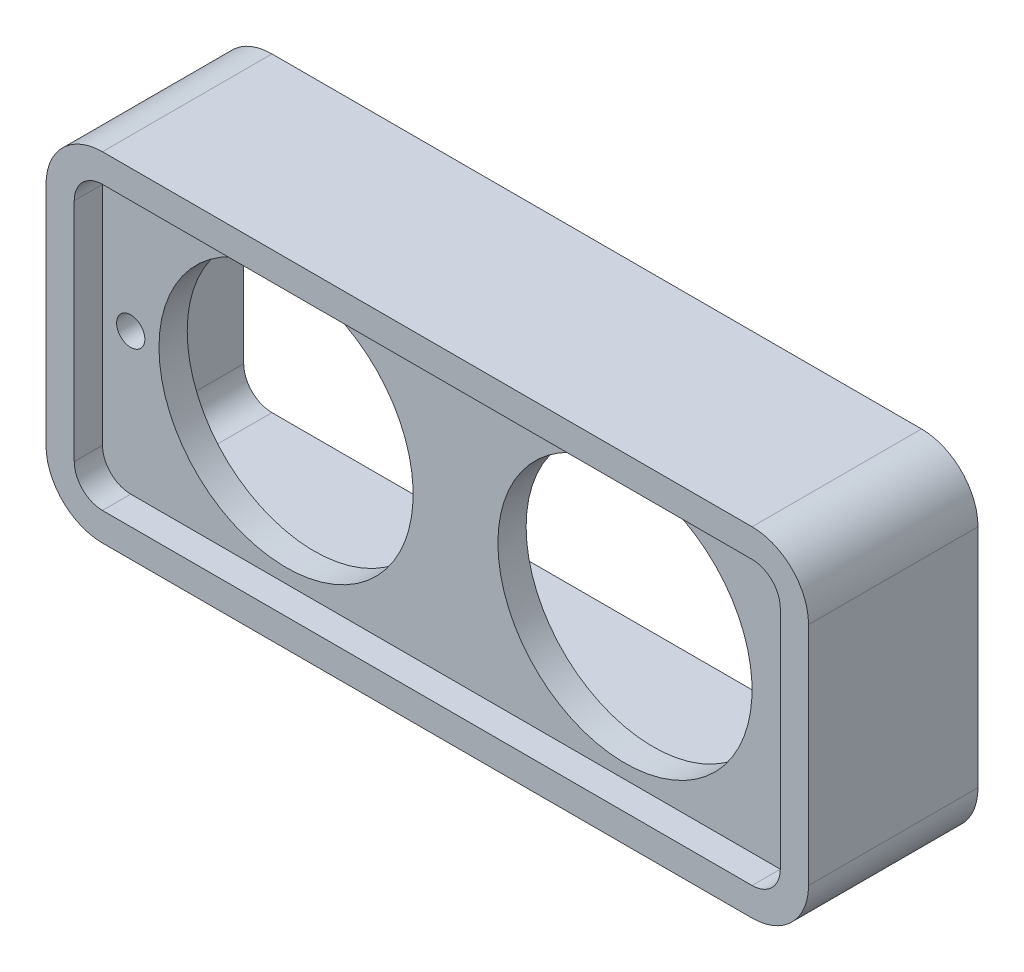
ISO-10303-21;
HEADER;
FILE_DESCRIPTION(('STEP AP214'),'2;1');
FILE_NAME('part.step','',(''),(''),'','','');
FILE_SCHEMA(('AUTOMOTIVE_DESIGN { 1 0 10303 214 1 1 1 1 }'));
ENDSEC;
DATA;
#1=APPLICATION_CONTEXT('core data for automotive mechanical design processes');
#2=APPLICATION_PROTOCOL_DEFINITION('international standard','automotive_design',2000,#1);
#3=PRODUCT_CONTEXT('',#1,'mechanical');
#4=PRODUCT('Part','Part','',(#3));
#5=PRODUCT_RELATED_PRODUCT_CATEGORY('part','',(#4));
#6=PRODUCT_DEFINITION_FORMATION('','',#4);
#7=PRODUCT_DEFINITION_CONTEXT('part definition',#1,'design');
#8=PRODUCT_DEFINITION('design','',#6,#7);
#9=PRODUCT_DEFINITION_SHAPE('','',#8);
#10=(LENGTH_UNIT() NAMED_UNIT(*) SI_UNIT(.MILLI.,.METRE.));
#11=(NAMED_UNIT(*) PLANE_ANGLE_UNIT() SI_UNIT($,.RADIAN.));
#12=(NAMED_UNIT(*) SI_UNIT($,.STERADIAN.) SOLID_ANGLE_UNIT());
#13=UNCERTAINTY_MEASURE_WITH_UNIT(LENGTH_MEASURE(1.E-05),#10,'distance_accuracy_value','');
#14=(GEOMETRIC_REPRESENTATION_CONTEXT(3) GLOBAL_UNCERTAINTY_ASSIGNED_CONTEXT((#13)) GLOBAL_UNIT_ASSIGNED_CONTEXT((#10,
#11,#12)) REPRESENTATION_CONTEXT('',''));
#15=CARTESIAN_POINT('',(0.,0.,0.));
#16=DIRECTION('',(0.,0.,1.));
#17=DIRECTION('',(1.,0.,0.));
#18=AXIS2_PLACEMENT_3D('',#15,#16,#17);
#19=CARTESIAN_POINT('',(-11.5,-4.,-6.));
#20=DIRECTION('',(0.,0.,1.));
#21=DIRECTION('',(1.,0.,0.));
#22=AXIS2_PLACEMENT_3D('',#19,#20,#21);
#23=CYLINDRICAL_SURFACE('',#22,2.);
#24=CARTESIAN_POINT('',(-11.5,-4.,0.));
#25=DIRECTION('',(0.,0.,1.));
#26=DIRECTION('',(-1.,0.,0.));
#27=AXIS2_PLACEMENT_3D('',#24,#25,#26);
#28=CIRCLE('',#27,2.);
#29=CARTESIAN_POINT('',(-13.5,-4.,0.));
#30=VERTEX_POINT('',#29);
#31=CARTESIAN_POINT('',(-11.5,-6.,0.));
#32=VERTEX_POINT('',#31);
#33=EDGE_CURVE('E364',#30,#32,#28,.T.);
#34=ORIENTED_EDGE('',*,*,#33,.F.);
#35=DIRECTION('',(0.,0.,1.));
#36=VECTOR('',#35,1.);
#37=CARTESIAN_POINT('',(-13.5,-4.,-6.));
#38=LINE('',#37,#36);
#39=CARTESIAN_POINT('',(-13.5,-4.,-6.));
#40=VERTEX_POINT('',#39);
#41=EDGE_CURVE('E11',#40,#30,#38,.T.);
#42=ORIENTED_EDGE('',*,*,#41,.F.);
#43=CARTESIAN_POINT('',(-11.5,-4.,-6.));
#44=DIRECTION('',(0.,0.,1.));
#45=DIRECTION('',(-1.,0.,0.));
#46=AXIS2_PLACEMENT_3D('',#43,#44,#45);
#47=CIRCLE('',#46,2.);
#48=CARTESIAN_POINT('',(-11.5,-6.,-6.));
#49=VERTEX_POINT('',#48);
#50=EDGE_CURVE('E338',#40,#49,#47,.T.);
#51=ORIENTED_EDGE('',*,*,#50,.T.);
#52=DIRECTION('',(0.,0.,1.));
#53=VECTOR('',#52,1.);
#54=CARTESIAN_POINT('',(-11.5,-6.,-6.));
#55=LINE('',#54,#53);
#56=EDGE_CURVE('E363',#49,#32,#55,.T.);
#57=ORIENTED_EDGE('',*,*,#56,.T.);
#58=EDGE_LOOP('',(#34,#42,#51,#57));
#59=FACE_BOUND('',#58,.T.);
#60=ADVANCED_FACE('F31',(#59),#23,.T.);
#61=CARTESIAN_POINT('',(-13.5,-4.,-6.));
#62=DIRECTION('',(-1.,0.,0.));
#63=DIRECTION('',(0.,0.,1.));
#64=AXIS2_PLACEMENT_3D('',#61,#62,#63);
#65=PLANE('',#64);
#66=DIRECTION('',(0.,-1.,0.));
#67=VECTOR('',#66,1.);
#68=CARTESIAN_POINT('',(-13.5,-4.,0.));
#69=LINE('',#68,#67);
#70=CARTESIAN_POINT('',(-13.5,4.,0.));
#71=VERTEX_POINT('',#70);
#72=EDGE_CURVE('E342',#71,#30,#69,.T.);
#73=ORIENTED_EDGE('',*,*,#72,.F.);
#74=DIRECTION('',(0.,0.,1.));
#75=VECTOR('',#74,1.);
#76=CARTESIAN_POINT('',(-13.5,4.,-6.));
#77=LINE('',#76,#75);
#78=CARTESIAN_POINT('',(-13.5,4.,-6.));
#79=VERTEX_POINT('',#78);
#80=EDGE_CURVE('E39',#79,#71,#77,.T.);
#81=ORIENTED_EDGE('',*,*,#80,.F.);
#82=DIRECTION('',(0.,-1.,0.));
#83=VECTOR('',#82,1.);
#84=CARTESIAN_POINT('',(-13.5,-4.,-6.));
#85=LINE('',#84,#83);
#86=EDGE_CURVE('E360',#79,#40,#85,.T.);
#87=ORIENTED_EDGE('',*,*,#86,.T.);
#88=ORIENTED_EDGE('',*,*,#41,.T.);
#89=EDGE_LOOP('',(#73,#81,#87,#88));
#90=FACE_BOUND('',#89,.T.);
#91=ADVANCED_FACE('F422',(#90),#65,.T.);
#92=CARTESIAN_POINT('',(-11.5,4.,-6.));
#93=DIRECTION('',(0.,0.,1.));
#94=DIRECTION('',(1.,0.,0.));
#95=AXIS2_PLACEMENT_3D('',#92,#93,#94);
#96=CYLINDRICAL_SURFACE('',#95,2.);
#97=CARTESIAN_POINT('',(-11.5,4.,0.));
#98=DIRECTION('',(0.,0.,1.));
#99=DIRECTION('',(-1.,0.,0.));
#100=AXIS2_PLACEMENT_3D('',#97,#98,#99);
#101=CIRCLE('',#100,2.);
#102=CARTESIAN_POINT('',(-11.5,6.,0.));
#103=VERTEX_POINT('',#102);
#104=EDGE_CURVE('E382',#103,#71,#101,.T.);
#105=ORIENTED_EDGE('',*,*,#104,.F.);
#106=DIRECTION('',(0.,0.,1.));
#107=VECTOR('',#106,1.);
#108=CARTESIAN_POINT('',(-11.5,6.,-6.));
#109=LINE('',#108,#107);
#110=CARTESIAN_POINT('',(-11.5,6.,-6.));
#111=VERTEX_POINT('',#110);
#112=EDGE_CURVE('E388',#111,#103,#109,.T.);
#113=ORIENTED_EDGE('',*,*,#112,.F.);
#114=CARTESIAN_POINT('',(-11.5,4.,-6.));
#115=DIRECTION('',(0.,0.,1.));
#116=DIRECTION('',(-1.,0.,0.));
#117=AXIS2_PLACEMENT_3D('',#114,#115,#116);
#118=CIRCLE('',#117,2.);
#119=EDGE_CURVE('E357',#111,#79,#118,.T.);
#120=ORIENTED_EDGE('',*,*,#119,.T.);
#121=ORIENTED_EDGE('',*,*,#80,.T.);
#122=EDGE_LOOP('',(#105,#113,#120,#121));
#123=FACE_BOUND('',#122,.T.);
#124=ADVANCED_FACE('F427',(#123),#96,.T.);
#125=CARTESIAN_POINT('',(-11.5,6.,-6.));
#126=DIRECTION('',(0.,1.,0.));
#127=DIRECTION('',(-1.,0.,0.));
#128=AXIS2_PLACEMENT_3D('',#125,#126,#127);
#129=PLANE('',#128);
#130=DIRECTION('',(-1.,0.,0.));
#131=VECTOR('',#130,1.);
#132=CARTESIAN_POINT('',(-11.5,6.,0.));
#133=LINE('',#132,#131);
#134=CARTESIAN_POINT('',(11.5,6.,0.));
#135=VERTEX_POINT('',#134);
#136=EDGE_CURVE('E379',#135,#103,#133,.T.);
#137=ORIENTED_EDGE('',*,*,#136,.F.);
#138=DIRECTION('',(0.,0.,1.));
#139=VECTOR('',#138,1.);
#140=CARTESIAN_POINT('',(11.5,6.,-6.));
#141=LINE('',#140,#139);
#142=CARTESIAN_POINT('',(11.5,6.,-6.));
#143=VERTEX_POINT('',#142);
#144=EDGE_CURVE('E390',#143,#135,#141,.T.);
#145=ORIENTED_EDGE('',*,*,#144,.F.);
#146=DIRECTION('',(-1.,0.,0.));
#147=VECTOR('',#146,1.);
#148=CARTESIAN_POINT('',(-11.5,6.,-6.));
#149=LINE('',#148,#147);
#150=EDGE_CURVE('E354',#143,#111,#149,.T.);
#151=ORIENTED_EDGE('',*,*,#150,.T.);
#152=ORIENTED_EDGE('',*,*,#112,.T.);
#153=EDGE_LOOP('',(#137,#145,#151,#152));
#154=FACE_BOUND('',#153,.T.);
#155=ADVANCED_FACE('F458',(#154),#129,.T.);
#156=CARTESIAN_POINT('',(11.5,4.,-6.));
#157=DIRECTION('',(0.,0.,1.));
#158=DIRECTION('',(1.,0.,0.));
#159=AXIS2_PLACEMENT_3D('',#156,#157,#158);
#160=CYLINDRICAL_SURFACE('',#159,2.);
#161=CARTESIAN_POINT('',(11.5,4.,0.));
#162=DIRECTION('',(0.,0.,1.));
#163=DIRECTION('',(-1.,0.,0.));
#164=AXIS2_PLACEMENT_3D('',#161,#162,#163);
#165=CIRCLE('',#164,2.);
#166=CARTESIAN_POINT('',(13.5,4.,0.));
#167=VERTEX_POINT('',#166);
#168=EDGE_CURVE('E376',#167,#135,#165,.T.);
#169=ORIENTED_EDGE('',*,*,#168,.F.);
#170=DIRECTION('',(0.,0.,1.));
#171=VECTOR('',#170,1.);
#172=CARTESIAN_POINT('',(13.5,4.,-6.));
#173=LINE('',#172,#171);
#174=CARTESIAN_POINT('',(13.5,4.,-6.));
#175=VERTEX_POINT('',#174);
#176=EDGE_CURVE('E392',#175,#167,#173,.T.);
#177=ORIENTED_EDGE('',*,*,#176,.F.);
#178=CARTESIAN_POINT('',(11.5,4.,-6.));
#179=DIRECTION('',(0.,0.,1.));
#180=DIRECTION('',(-1.,0.,0.));
#181=AXIS2_PLACEMENT_3D('',#178,#179,#180);
#182=CIRCLE('',#181,2.);
#183=EDGE_CURVE('E351',#175,#143,#182,.T.);
#184=ORIENTED_EDGE('',*,*,#183,.T.);
#185=ORIENTED_EDGE('',*,*,#144,.T.);
#186=EDGE_LOOP('',(#169,#177,#184,#185));
#187=FACE_BOUND('',#186,.T.);
#188=ADVANCED_FACE('F455',(#187),#160,.T.);
#189=CARTESIAN_POINT('',(13.5,-4.,-6.));
#190=DIRECTION('',(1.,0.,0.));
#191=DIRECTION('',(0.,0.,-1.));
#192=AXIS2_PLACEMENT_3D('',#189,#190,#191);
#193=PLANE('',#192);
#194=DIRECTION('',(0.,1.,0.));
#195=VECTOR('',#194,1.);
#196=CARTESIAN_POINT('',(13.5,-4.,0.));
#197=LINE('',#196,#195);
#198=CARTESIAN_POINT('',(13.5,-4.,0.));
#199=VERTEX_POINT('',#198);
#200=EDGE_CURVE('E373',#199,#167,#197,.T.);
#201=ORIENTED_EDGE('',*,*,#200,.F.);
#202=DIRECTION('',(0.,0.,1.));
#203=VECTOR('',#202,1.);
#204=CARTESIAN_POINT('',(13.5,-4.,-6.));
#205=LINE('',#204,#203);
#206=CARTESIAN_POINT('',(13.5,-4.,-6.));
#207=VERTEX_POINT('',#206);
#208=EDGE_CURVE('E394',#207,#199,#205,.T.);
#209=ORIENTED_EDGE('',*,*,#208,.F.);
#210=DIRECTION('',(0.,1.,0.));
#211=VECTOR('',#210,1.);
#212=CARTESIAN_POINT('',(13.5,-4.,-6.));
#213=LINE('',#212,#211);
#214=EDGE_CURVE('E348',#207,#175,#213,.T.);
#215=ORIENTED_EDGE('',*,*,#214,.T.);
#216=ORIENTED_EDGE('',*,*,#176,.T.);
#217=EDGE_LOOP('',(#201,#209,#215,#216));
#218=FACE_BOUND('',#217,.T.);
#219=ADVANCED_FACE('F451',(#218),#193,.T.);
#220=CARTESIAN_POINT('',(11.5,-4.,-6.));
#221=DIRECTION('',(0.,0.,1.));
#222=DIRECTION('',(1.,0.,0.));
#223=AXIS2_PLACEMENT_3D('',#220,#221,#222);
#224=CYLINDRICAL_SURFACE('',#223,2.);
#225=CARTESIAN_POINT('',(11.5,-4.,0.));
#226=DIRECTION('',(0.,0.,1.));
#227=DIRECTION('',(1.,0.,0.));
#228=AXIS2_PLACEMENT_3D('',#225,#226,#227);
#229=CIRCLE('',#228,2.);
#230=CARTESIAN_POINT('',(11.5,-6.,0.));
#231=VERTEX_POINT('',#230);
#232=EDGE_CURVE('E370',#231,#199,#229,.T.);
#233=ORIENTED_EDGE('',*,*,#232,.F.);
#234=DIRECTION('',(0.,0.,1.));
#235=VECTOR('',#234,1.);
#236=CARTESIAN_POINT('',(11.5,-6.,-6.));
#237=LINE('',#236,#235);
#238=CARTESIAN_POINT('',(11.5,-6.,-6.));
#239=VERTEX_POINT('',#238);
#240=EDGE_CURVE('E396',#239,#231,#237,.T.);
#241=ORIENTED_EDGE('',*,*,#240,.F.);
#242=CARTESIAN_POINT('',(11.5,-4.,-6.));
#243=DIRECTION('',(0.,0.,1.));
#244=DIRECTION('',(1.,0.,0.));
#245=AXIS2_PLACEMENT_3D('',#242,#243,#244);
#246=CIRCLE('',#245,2.);
#247=EDGE_CURVE('E345',#239,#207,#246,.T.);
#248=ORIENTED_EDGE('',*,*,#247,.T.);
#249=ORIENTED_EDGE('',*,*,#208,.T.);
#250=EDGE_LOOP('',(#233,#241,#248,#249));
#251=FACE_BOUND('',#250,.T.);
#252=ADVANCED_FACE('F449',(#251),#224,.T.);
#253=CARTESIAN_POINT('',(-11.5,-6.,-6.));
#254=DIRECTION('',(0.,-1.,0.));
#255=DIRECTION('',(1.,0.,0.));
#256=AXIS2_PLACEMENT_3D('',#253,#254,#255);
#257=PLANE('',#256);
#258=DIRECTION('',(1.,0.,0.));
#259=VECTOR('',#258,1.);
#260=CARTESIAN_POINT('',(-11.5,-6.,0.));
#261=LINE('',#260,#259);
#262=EDGE_CURVE('E367',#32,#231,#261,.T.);
#263=ORIENTED_EDGE('',*,*,#262,.F.);
#264=ORIENTED_EDGE('',*,*,#56,.F.);
#265=DIRECTION('',(1.,0.,0.));
#266=VECTOR('',#265,1.);
#267=CARTESIAN_POINT('',(-11.5,-6.,-6.));
#268=LINE('',#267,#266);
#269=EDGE_CURVE('E341',#49,#239,#268,.T.);
#270=ORIENTED_EDGE('',*,*,#269,.T.);
#271=ORIENTED_EDGE('',*,*,#240,.T.);
#272=EDGE_LOOP('',(#263,#264,#270,#271));
#273=FACE_BOUND('',#272,.T.);
#274=ADVANCED_FACE('F445',(#273),#257,.T.);
#275=CARTESIAN_POINT('',(-11.5,-4.,-6.));
#276=DIRECTION('',(0.,0.,-1.));
#277=DIRECTION('',(-1.,0.,0.));
#278=AXIS2_PLACEMENT_3D('',#275,#276,#277);
#279=PLANE('',#278);
#280=CARTESIAN_POINT('',(-11.5,4.,-6.));
#281=DIRECTION('',(0.,0.,-1.));
#282=DIRECTION('',(1.,0.,0.));
#283=AXIS2_PLACEMENT_3D('',#280,#281,#282);
#284=CIRCLE('',#283,1.);
#285=CARTESIAN_POINT('',(-12.5,4.,-6.));
#286=VERTEX_POINT('',#285);
#287=CARTESIAN_POINT('',(-11.5,5.,-6.));
#288=VERTEX_POINT('',#287);
#289=EDGE_CURVE('E55',#286,#288,#284,.T.);
#290=ORIENTED_EDGE('',*,*,#289,.F.);
#291=DIRECTION('',(0.,1.,0.));
#292=VECTOR('',#291,1.);
#293=CARTESIAN_POINT('',(-12.5,-4.,-6.));
#294=LINE('',#293,#292);
#295=CARTESIAN_POINT('',(-12.5,-4.,-6.));
#296=VERTEX_POINT('',#295);
#297=EDGE_CURVE('E279',#296,#286,#294,.T.);
#298=ORIENTED_EDGE('',*,*,#297,.F.);
#299=CARTESIAN_POINT('',(-11.5,-4.,-6.));
#300=DIRECTION('',(0.,0.,-1.));
#301=DIRECTION('',(-1.,0.,0.));
#302=AXIS2_PLACEMENT_3D('',#299,#300,#301);
#303=CIRCLE('',#302,1.);
#304=CARTESIAN_POINT('',(-11.5,-5.,-6.));
#305=VERTEX_POINT('',#304);
#306=EDGE_CURVE('E317',#305,#296,#303,.T.);
#307=ORIENTED_EDGE('',*,*,#306,.F.);
#308=DIRECTION('',(-1.,0.,0.));
#309=VECTOR('',#308,1.);
#310=CARTESIAN_POINT('',(11.5,-5.,-6.));
#311=LINE('',#310,#309);
#312=CARTESIAN_POINT('',(11.5,-5.,-6.));
#313=VERTEX_POINT('',#312);
#314=EDGE_CURVE('E314',#313,#305,#311,.T.);
#315=ORIENTED_EDGE('',*,*,#314,.F.);
#316=CARTESIAN_POINT('',(11.5,-4.,-6.));
#317=DIRECTION('',(0.,0.,-1.));
#318=DIRECTION('',(1.,0.,0.));
#319=AXIS2_PLACEMENT_3D('',#316,#317,#318);
#320=CIRCLE('',#319,1.);
#321=CARTESIAN_POINT('',(12.5,-4.,-6.));
#322=VERTEX_POINT('',#321);
#323=EDGE_CURVE('E311',#322,#313,#320,.T.);
#324=ORIENTED_EDGE('',*,*,#323,.F.);
#325=DIRECTION('',(0.,-1.,0.));
#326=VECTOR('',#325,1.);
#327=CARTESIAN_POINT('',(12.5,-4.,-6.));
#328=LINE('',#327,#326);
#329=CARTESIAN_POINT('',(12.5,4.,-6.));
#330=VERTEX_POINT('',#329);
#331=EDGE_CURVE('E308',#330,#322,#328,.T.);
#332=ORIENTED_EDGE('',*,*,#331,.F.);
#333=CARTESIAN_POINT('',(11.5,4.,-6.));
#334=DIRECTION('',(0.,0.,-1.));
#335=DIRECTION('',(1.,0.,0.));
#336=AXIS2_PLACEMENT_3D('',#333,#334,#335);
#337=CIRCLE('',#336,1.);
#338=CARTESIAN_POINT('',(11.5,5.,-6.));
#339=VERTEX_POINT('',#338);
#340=EDGE_CURVE('E305',#339,#330,#337,.T.);
#341=ORIENTED_EDGE('',*,*,#340,.F.);
#342=DIRECTION('',(1.,0.,0.));
#343=VECTOR('',#342,1.);
#344=CARTESIAN_POINT('',(11.5,5.,-6.));
#345=LINE('',#344,#343);
#346=EDGE_CURVE('E302',#288,#339,#345,.T.);
#347=ORIENTED_EDGE('',*,*,#346,.F.);
#348=EDGE_LOOP('',(#290,#298,#307,#315,#324,#332,#341,#347));
#349=FACE_BOUND('',#348,.T.);
#350=ORIENTED_EDGE('',*,*,#50,.F.);
#351=ORIENTED_EDGE('',*,*,#86,.F.);
#352=ORIENTED_EDGE('',*,*,#119,.F.);
#353=ORIENTED_EDGE('',*,*,#150,.F.);
#354=ORIENTED_EDGE('',*,*,#183,.F.);
#355=ORIENTED_EDGE('',*,*,#214,.F.);
#356=ORIENTED_EDGE('',*,*,#247,.F.);
#357=ORIENTED_EDGE('',*,*,#269,.F.);
#358=EDGE_LOOP('',(#350,#351,#352,#353,#354,#355,#356,#357));
#359=FACE_BOUND('',#358,.T.);
#360=ADVANCED_FACE('F439',(#349,#359),#279,.T.);
#361=CARTESIAN_POINT('',(-11.5,-4.,0.));
#362=DIRECTION('',(0.,0.,-1.));
#363=DIRECTION('',(-1.,0.,0.));
#364=AXIS2_PLACEMENT_3D('',#361,#362,#363);
#365=PLANE('',#364);
#366=DIRECTION('',(-1.,0.,0.));
#367=VECTOR('',#366,1.);
#368=CARTESIAN_POINT('',(-11.5,5.,0.));
#369=LINE('',#368,#367);
#370=CARTESIAN_POINT('',(11.5,5.,0.));
#371=VERTEX_POINT('',#370);
#372=CARTESIAN_POINT('',(-11.5,5.,0.));
#373=VERTEX_POINT('',#372);
#374=EDGE_CURVE('E234',#371,#373,#369,.T.);
#375=ORIENTED_EDGE('',*,*,#374,.F.);
#376=CARTESIAN_POINT('',(11.5,4.,0.));
#377=DIRECTION('',(0.,0.,1.));
#378=DIRECTION('',(-1.,0.,0.));
#379=AXIS2_PLACEMENT_3D('',#376,#377,#378);
#380=CIRCLE('',#379,1.);
#381=CARTESIAN_POINT('',(12.5,4.,0.));
#382=VERTEX_POINT('',#381);
#383=EDGE_CURVE('E47',#382,#371,#380,.T.);
#384=ORIENTED_EDGE('',*,*,#383,.F.);
#385=DIRECTION('',(0.,1.,0.));
#386=VECTOR('',#385,1.);
#387=CARTESIAN_POINT('',(12.5,-4.,0.));
#388=LINE('',#387,#386);
#389=CARTESIAN_POINT('',(12.5,-4.,0.));
#390=VERTEX_POINT('',#389);
#391=EDGE_CURVE('E214',#390,#382,#388,.T.);
#392=ORIENTED_EDGE('',*,*,#391,.F.);
#393=CARTESIAN_POINT('',(11.5,-4.,0.));
#394=DIRECTION('',(0.,0.,1.));
#395=DIRECTION('',(1.,0.,0.));
#396=AXIS2_PLACEMENT_3D('',#393,#394,#395);
#397=CIRCLE('',#396,1.);
#398=CARTESIAN_POINT('',(11.5,-5.,0.));
#399=VERTEX_POINT('',#398);
#400=EDGE_CURVE('E217',#399,#390,#397,.T.);
#401=ORIENTED_EDGE('',*,*,#400,.F.);
#402=DIRECTION('',(1.,0.,0.));
#403=VECTOR('',#402,1.);
#404=CARTESIAN_POINT('',(-11.5,-5.,0.));
#405=LINE('',#404,#403);
#406=CARTESIAN_POINT('',(-11.5,-5.,0.));
#407=VERTEX_POINT('',#406);
#408=EDGE_CURVE('E245',#407,#399,#405,.T.);
#409=ORIENTED_EDGE('',*,*,#408,.F.);
#410=CARTESIAN_POINT('',(-11.5,-4.,0.));
#411=DIRECTION('',(0.,0.,1.));
#412=DIRECTION('',(-1.,0.,0.));
#413=AXIS2_PLACEMENT_3D('',#410,#411,#412);
#414=CIRCLE('',#413,1.);
#415=CARTESIAN_POINT('',(-12.5,-4.,0.));
#416=VERTEX_POINT('',#415);
#417=EDGE_CURVE('E242',#416,#407,#414,.T.);
#418=ORIENTED_EDGE('',*,*,#417,.F.);
#419=DIRECTION('',(0.,-1.,0.));
#420=VECTOR('',#419,1.);
#421=CARTESIAN_POINT('',(-12.5,-4.,0.));
#422=LINE('',#421,#420);
#423=CARTESIAN_POINT('',(-12.5,4.,0.));
#424=VERTEX_POINT('',#423);
#425=EDGE_CURVE('E239',#424,#416,#422,.T.);
#426=ORIENTED_EDGE('',*,*,#425,.F.);
#427=CARTESIAN_POINT('',(-11.5,4.,0.));
#428=DIRECTION('',(0.,0.,1.));
#429=DIRECTION('',(-1.,0.,0.));
#430=AXIS2_PLACEMENT_3D('',#427,#428,#429);
#431=CIRCLE('',#430,1.);
#432=EDGE_CURVE('E236',#373,#424,#431,.T.);
#433=ORIENTED_EDGE('',*,*,#432,.F.);
#434=EDGE_LOOP('',(#375,#384,#392,#401,#409,#418,#426,#433));
#435=FACE_BOUND('',#434,.T.);
#436=ORIENTED_EDGE('',*,*,#33,.T.);
#437=ORIENTED_EDGE('',*,*,#262,.T.);
#438=ORIENTED_EDGE('',*,*,#232,.T.);
#439=ORIENTED_EDGE('',*,*,#200,.T.);
#440=ORIENTED_EDGE('',*,*,#168,.T.);
#441=ORIENTED_EDGE('',*,*,#136,.T.);
#442=ORIENTED_EDGE('',*,*,#104,.T.);
#443=ORIENTED_EDGE('',*,*,#72,.T.);
#444=EDGE_LOOP('',(#436,#437,#438,#439,#440,#441,#442,#443));
#445=FACE_BOUND('',#444,.T.);
#446=ADVANCED_FACE('F414',(#435,#445),#365,.F.);
#447=CARTESIAN_POINT('',(-11.5,0.,-6.));
#448=DIRECTION('',(0.,0.,1.));
#449=DIRECTION('',(1.,0.,0.));
#450=AXIS2_PLACEMENT_3D('',#447,#448,#449);
#451=CYLINDRICAL_SURFACE('',#450,0.500000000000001);
#452=CARTESIAN_POINT('',(-11.5,0.,-1.));
#453=DIRECTION('',(0.,0.,-1.));
#454=DIRECTION('',(-1.,0.,0.));
#455=AXIS2_PLACEMENT_3D('',#452,#453,#454);
#456=CIRCLE('',#455,0.500000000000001);
#457=CARTESIAN_POINT('',(-12.,0.,-1.));
#458=VERTEX_POINT('',#457);
#459=EDGE_CURVE('E266',#458,#458,#456,.F.);
#460=ORIENTED_EDGE('',*,*,#459,.T.);
#461=EDGE_LOOP('',(#460));
#462=FACE_BOUND('',#461,.T.);
#463=CARTESIAN_POINT('',(-11.5,0.,-2.));
#464=DIRECTION('',(0.,0.,1.));
#465=DIRECTION('',(1.,0.,0.));
#466=AXIS2_PLACEMENT_3D('',#463,#464,#465);
#467=CIRCLE('',#466,0.500000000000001);
#468=CARTESIAN_POINT('',(-11.,0.,-2.));
#469=VERTEX_POINT('',#468);
#470=EDGE_CURVE('E324',#469,#469,#467,.F.);
#471=ORIENTED_EDGE('',*,*,#470,.T.);
#472=EDGE_LOOP('',(#471));
#473=FACE_BOUND('',#472,.T.);
#474=ADVANCED_FACE('F401',(#462,#473),#451,.F.);
#475=CARTESIAN_POINT('',(-11.5,4.,-2.));
#476=DIRECTION('',(0.,0.,1.));
#477=DIRECTION('',(1.,0.,0.));
#478=AXIS2_PLACEMENT_3D('',#475,#476,#477);
#479=PLANE('',#478);
#480=CARTESIAN_POINT('',(6.,0.,-2.));
#481=DIRECTION('',(0.,0.,-1.));
#482=DIRECTION('',(-1.,0.,0.));
#483=AXIS2_PLACEMENT_3D('',#480,#481,#482);
#484=CIRCLE('',#483,4.5);
#485=CARTESIAN_POINT('',(1.5,0.,-2.));
#486=VERTEX_POINT('',#485);
#487=EDGE_CURVE('E269',#486,#486,#484,.T.);
#488=ORIENTED_EDGE('',*,*,#487,.F.);
#489=EDGE_LOOP('',(#488));
#490=FACE_BOUND('',#489,.T.);
#491=CARTESIAN_POINT('',(-6.,0.,-2.));
#492=DIRECTION('',(0.,0.,-1.));
#493=DIRECTION('',(-1.,0.,0.));
#494=AXIS2_PLACEMENT_3D('',#491,#492,#493);
#495=CIRCLE('',#494,4.5);
#496=CARTESIAN_POINT('',(-10.5,0.,-2.));
#497=VERTEX_POINT('',#496);
#498=EDGE_CURVE('E272',#497,#497,#495,.T.);
#499=ORIENTED_EDGE('',*,*,#498,.F.);
#500=EDGE_LOOP('',(#499));
#501=FACE_BOUND('',#500,.T.);
#502=CARTESIAN_POINT('',(-11.5,4.,-2.));
#503=DIRECTION('',(0.,0.,-1.));
#504=DIRECTION('',(1.,0.,0.));
#505=AXIS2_PLACEMENT_3D('',#502,#503,#504);
#506=CIRCLE('',#505,1.);
#507=CARTESIAN_POINT('',(-12.5,4.,-2.));
#508=VERTEX_POINT('',#507);
#509=CARTESIAN_POINT('',(-11.5,5.,-2.));
#510=VERTEX_POINT('',#509);
#511=EDGE_CURVE('E275',#508,#510,#506,.T.);
#512=ORIENTED_EDGE('',*,*,#511,.T.);
#513=DIRECTION('',(1.,0.,0.));
#514=VECTOR('',#513,1.);
#515=CARTESIAN_POINT('',(11.5,5.,-2.));
#516=LINE('',#515,#514);
#517=CARTESIAN_POINT('',(11.5,5.,-2.));
#518=VERTEX_POINT('',#517);
#519=EDGE_CURVE('E278',#510,#518,#516,.T.);
#520=ORIENTED_EDGE('',*,*,#519,.T.);
#521=CARTESIAN_POINT('',(11.5,4.,-2.));
#522=DIRECTION('',(0.,0.,-1.));
#523=DIRECTION('',(1.,0.,0.));
#524=AXIS2_PLACEMENT_3D('',#521,#522,#523);
#525=CIRCLE('',#524,1.);
#526=CARTESIAN_POINT('',(12.5,4.,-2.));
#527=VERTEX_POINT('',#526);
#528=EDGE_CURVE('E282',#518,#527,#525,.T.);
#529=ORIENTED_EDGE('',*,*,#528,.T.);
#530=DIRECTION('',(0.,-1.,0.));
#531=VECTOR('',#530,1.);
#532=CARTESIAN_POINT('',(12.5,-4.,-2.));
#533=LINE('',#532,#531);
#534=CARTESIAN_POINT('',(12.5,-4.,-2.));
#535=VERTEX_POINT('',#534);
#536=EDGE_CURVE('E285',#527,#535,#533,.T.);
#537=ORIENTED_EDGE('',*,*,#536,.T.);
#538=CARTESIAN_POINT('',(11.5,-4.,-2.));
#539=DIRECTION('',(0.,0.,-1.));
#540=DIRECTION('',(1.,0.,0.));
#541=AXIS2_PLACEMENT_3D('',#538,#539,#540);
#542=CIRCLE('',#541,1.);
#543=CARTESIAN_POINT('',(11.5,-5.,-2.));
#544=VERTEX_POINT('',#543);
#545=EDGE_CURVE('E288',#535,#544,#542,.T.);
#546=ORIENTED_EDGE('',*,*,#545,.T.);
#547=DIRECTION('',(-1.,0.,0.));
#548=VECTOR('',#547,1.);
#549=CARTESIAN_POINT('',(11.5,-5.,-2.));
#550=LINE('',#549,#548);
#551=CARTESIAN_POINT('',(-11.5,-5.,-2.));
#552=VERTEX_POINT('',#551);
#553=EDGE_CURVE('E291',#544,#552,#550,.T.);
#554=ORIENTED_EDGE('',*,*,#553,.T.);
#555=CARTESIAN_POINT('',(-11.5,-4.,-2.));
#556=DIRECTION('',(0.,0.,-1.));
#557=DIRECTION('',(-1.,0.,0.));
#558=AXIS2_PLACEMENT_3D('',#555,#556,#557);
#559=CIRCLE('',#558,1.);
#560=CARTESIAN_POINT('',(-12.5,-4.,-2.));
#561=VERTEX_POINT('',#560);
#562=EDGE_CURVE('E294',#552,#561,#559,.T.);
#563=ORIENTED_EDGE('',*,*,#562,.T.);
#564=DIRECTION('',(0.,1.,0.));
#565=VECTOR('',#564,1.);
#566=CARTESIAN_POINT('',(-12.5,-4.,-2.));
#567=LINE('',#566,#565);
#568=EDGE_CURVE('E297',#561,#508,#567,.T.);
#569=ORIENTED_EDGE('',*,*,#568,.T.);
#570=EDGE_LOOP('',(#512,#520,#529,#537,#546,#554,#563,#569));
#571=FACE_BOUND('',#570,.T.);
#572=ORIENTED_EDGE('',*,*,#470,.F.);
#573=EDGE_LOOP('',(#572));
#574=FACE_BOUND('',#573,.T.);
#575=ADVANCED_FACE('F403',(#490,#501,#571,#574),#479,.F.);
#576=CARTESIAN_POINT('',(-11.5,4.,-2.));
#577=DIRECTION('',(0.,0.,-1.));
#578=DIRECTION('',(-1.,0.,0.));
#579=AXIS2_PLACEMENT_3D('',#576,#577,#578);
#580=CYLINDRICAL_SURFACE('',#579,1.);
#581=ORIENTED_EDGE('',*,*,#289,.T.);
#582=DIRECTION('',(0.,0.,-1.));
#583=VECTOR('',#582,1.);
#584=CARTESIAN_POINT('',(-11.5,5.,-2.));
#585=LINE('',#584,#583);
#586=EDGE_CURVE('E300',#510,#288,#585,.T.);
#587=ORIENTED_EDGE('',*,*,#586,.F.);
#588=ORIENTED_EDGE('',*,*,#511,.F.);
#589=DIRECTION('',(0.,0.,-1.));
#590=VECTOR('',#589,1.);
#591=CARTESIAN_POINT('',(-12.5,4.,-2.));
#592=LINE('',#591,#590);
#593=EDGE_CURVE('E322',#508,#286,#592,.T.);
#594=ORIENTED_EDGE('',*,*,#593,.T.);
#595=EDGE_LOOP('',(#581,#587,#588,#594));
#596=FACE_BOUND('',#595,.T.);
#597=ADVANCED_FACE('F405',(#596),#580,.F.);
#598=CARTESIAN_POINT('',(-12.5,-4.,-2.));
#599=DIRECTION('',(-1.,0.,0.));
#600=DIRECTION('',(0.,0.,1.));
#601=AXIS2_PLACEMENT_3D('',#598,#599,#600);
#602=PLANE('',#601);
#603=ORIENTED_EDGE('',*,*,#297,.T.);
#604=ORIENTED_EDGE('',*,*,#593,.F.);
#605=ORIENTED_EDGE('',*,*,#568,.F.);
#606=DIRECTION('',(0.,0.,-1.));
#607=VECTOR('',#606,1.);
#608=CARTESIAN_POINT('',(-12.5,-4.,-2.));
#609=LINE('',#608,#607);
#610=EDGE_CURVE('E325',#561,#296,#609,.T.);
#611=ORIENTED_EDGE('',*,*,#610,.T.);
#612=EDGE_LOOP('',(#603,#604,#605,#611));
#613=FACE_BOUND('',#612,.T.);
#614=ADVANCED_FACE('F412',(#613),#602,.F.);
#615=CARTESIAN_POINT('',(-11.5,-4.,-2.));
#616=DIRECTION('',(0.,0.,-1.));
#617=DIRECTION('',(-1.,0.,0.));
#618=AXIS2_PLACEMENT_3D('',#615,#616,#617);
#619=CYLINDRICAL_SURFACE('',#618,1.);
#620=ORIENTED_EDGE('',*,*,#306,.T.);
#621=ORIENTED_EDGE('',*,*,#610,.F.);
#622=ORIENTED_EDGE('',*,*,#562,.F.);
#623=DIRECTION('',(0.,0.,-1.));
#624=VECTOR('',#623,1.);
#625=CARTESIAN_POINT('',(-11.5,-5.,-2.));
#626=LINE('',#625,#624);
#627=EDGE_CURVE('E327',#552,#305,#626,.T.);
#628=ORIENTED_EDGE('',*,*,#627,.T.);
#629=EDGE_LOOP('',(#620,#621,#622,#628));
#630=FACE_BOUND('',#629,.T.);
#631=ADVANCED_FACE('F504',(#630),#619,.F.);
#632=CARTESIAN_POINT('',(11.5,-5.,-2.));
#633=DIRECTION('',(0.,-1.,0.));
#634=DIRECTION('',(0.,0.,-1.));
#635=AXIS2_PLACEMENT_3D('',#632,#633,#634);
#636=PLANE('',#635);
#637=ORIENTED_EDGE('',*,*,#314,.T.);
#638=ORIENTED_EDGE('',*,*,#627,.F.);
#639=ORIENTED_EDGE('',*,*,#553,.F.);
#640=DIRECTION('',(0.,0.,-1.));
#641=VECTOR('',#640,1.);
#642=CARTESIAN_POINT('',(11.5,-5.,-2.));
#643=LINE('',#642,#641);
#644=EDGE_CURVE('E329',#544,#313,#643,.T.);
#645=ORIENTED_EDGE('',*,*,#644,.T.);
#646=EDGE_LOOP('',(#637,#638,#639,#645));
#647=FACE_BOUND('',#646,.T.);
#648=ADVANCED_FACE('F500',(#647),#636,.F.);
#649=CARTESIAN_POINT('',(11.5,-4.,-2.));
#650=DIRECTION('',(0.,0.,-1.));
#651=DIRECTION('',(-1.,0.,0.));
#652=AXIS2_PLACEMENT_3D('',#649,#650,#651);
#653=CYLINDRICAL_SURFACE('',#652,1.);
#654=ORIENTED_EDGE('',*,*,#323,.T.);
#655=ORIENTED_EDGE('',*,*,#644,.F.);
#656=ORIENTED_EDGE('',*,*,#545,.F.);
#657=DIRECTION('',(0.,0.,-1.));
#658=VECTOR('',#657,1.);
#659=CARTESIAN_POINT('',(12.5,-4.,-2.));
#660=LINE('',#659,#658);
#661=EDGE_CURVE('E331',#535,#322,#660,.T.);
#662=ORIENTED_EDGE('',*,*,#661,.T.);
#663=EDGE_LOOP('',(#654,#655,#656,#662));
#664=FACE_BOUND('',#663,.T.);
#665=ADVANCED_FACE('F496',(#664),#653,.F.);
#666=CARTESIAN_POINT('',(12.5,-4.,-2.));
#667=DIRECTION('',(1.,0.,0.));
#668=DIRECTION('',(0.,0.,-1.));
#669=AXIS2_PLACEMENT_3D('',#666,#667,#668);
#670=PLANE('',#669);
#671=ORIENTED_EDGE('',*,*,#331,.T.);
#672=ORIENTED_EDGE('',*,*,#661,.F.);
#673=ORIENTED_EDGE('',*,*,#536,.F.);
#674=DIRECTION('',(0.,0.,-1.));
#675=VECTOR('',#674,1.);
#676=CARTESIAN_POINT('',(12.5,4.,-2.));
#677=LINE('',#676,#675);
#678=EDGE_CURVE('E333',#527,#330,#677,.T.);
#679=ORIENTED_EDGE('',*,*,#678,.T.);
#680=EDGE_LOOP('',(#671,#672,#673,#679));
#681=FACE_BOUND('',#680,.T.);
#682=ADVANCED_FACE('F492',(#681),#670,.F.);
#683=CARTESIAN_POINT('',(11.5,4.,-2.));
#684=DIRECTION('',(0.,0.,-1.));
#685=DIRECTION('',(-1.,0.,0.));
#686=AXIS2_PLACEMENT_3D('',#683,#684,#685);
#687=CYLINDRICAL_SURFACE('',#686,1.);
#688=ORIENTED_EDGE('',*,*,#340,.T.);
#689=ORIENTED_EDGE('',*,*,#678,.F.);
#690=ORIENTED_EDGE('',*,*,#528,.F.);
#691=DIRECTION('',(0.,0.,-1.));
#692=VECTOR('',#691,1.);
#693=CARTESIAN_POINT('',(11.5,5.,-2.));
#694=LINE('',#693,#692);
#695=EDGE_CURVE('E335',#518,#339,#694,.T.);
#696=ORIENTED_EDGE('',*,*,#695,.T.);
#697=EDGE_LOOP('',(#688,#689,#690,#696));
#698=FACE_BOUND('',#697,.T.);
#699=ADVANCED_FACE('F488',(#698),#687,.F.);
#700=CARTESIAN_POINT('',(11.5,5.,-2.));
#701=DIRECTION('',(0.,1.,0.));
#702=DIRECTION('',(0.,0.,1.));
#703=AXIS2_PLACEMENT_3D('',#700,#701,#702);
#704=PLANE('',#703);
#705=ORIENTED_EDGE('',*,*,#346,.T.);
#706=ORIENTED_EDGE('',*,*,#695,.F.);
#707=ORIENTED_EDGE('',*,*,#519,.F.);
#708=ORIENTED_EDGE('',*,*,#586,.T.);
#709=EDGE_LOOP('',(#705,#706,#707,#708));
#710=FACE_BOUND('',#709,.T.);
#711=ADVANCED_FACE('F484',(#710),#704,.F.);
#712=CARTESIAN_POINT('',(-6.,0.,0.));
#713=DIRECTION('',(0.,0.,-1.));
#714=DIRECTION('',(-1.,0.,0.));
#715=AXIS2_PLACEMENT_3D('',#712,#713,#714);
#716=CYLINDRICAL_SURFACE('',#715,4.5);
#717=CARTESIAN_POINT('',(-6.,0.,-1.));
#718=DIRECTION('',(0.,0.,-1.));
#719=DIRECTION('',(-1.,0.,0.));
#720=AXIS2_PLACEMENT_3D('',#717,#718,#719);
#721=CIRCLE('',#720,4.5);
#722=CARTESIAN_POINT('',(-10.5,0.,-1.));
#723=VERTEX_POINT('',#722);
#724=EDGE_CURVE('E263',#723,#723,#721,.F.);
#725=ORIENTED_EDGE('',*,*,#724,.T.);
#726=EDGE_LOOP('',(#725));
#727=FACE_BOUND('',#726,.T.);
#728=ORIENTED_EDGE('',*,*,#498,.T.);
#729=EDGE_LOOP('',(#728));
#730=FACE_BOUND('',#729,.T.);
#731=ADVANCED_FACE('F487',(#727,#730),#716,.F.);
#732=CARTESIAN_POINT('',(6.,0.,0.));
#733=DIRECTION('',(0.,0.,-1.));
#734=DIRECTION('',(-1.,0.,0.));
#735=AXIS2_PLACEMENT_3D('',#732,#733,#734);
#736=CYLINDRICAL_SURFACE('',#735,4.5);
#737=CARTESIAN_POINT('',(6.,0.,-1.));
#738=DIRECTION('',(0.,0.,-1.));
#739=DIRECTION('',(-1.,0.,0.));
#740=AXIS2_PLACEMENT_3D('',#737,#738,#739);
#741=CIRCLE('',#740,4.5);
#742=CARTESIAN_POINT('',(1.5,0.,-1.));
#743=VERTEX_POINT('',#742);
#744=EDGE_CURVE('E34',#743,#743,#741,.F.);
#745=ORIENTED_EDGE('',*,*,#744,.T.);
#746=EDGE_LOOP('',(#745));
#747=FACE_BOUND('',#746,.T.);
#748=ORIENTED_EDGE('',*,*,#487,.T.);
#749=EDGE_LOOP('',(#748));
#750=FACE_BOUND('',#749,.T.);
#751=ADVANCED_FACE('F560',(#747,#750),#736,.F.);
#752=CARTESIAN_POINT('',(11.5,4.,-1.));
#753=DIRECTION('',(0.,0.,-1.));
#754=DIRECTION('',(-1.,0.,0.));
#755=AXIS2_PLACEMENT_3D('',#752,#753,#754);
#756=PLANE('',#755);
#757=ORIENTED_EDGE('',*,*,#724,.F.);
#758=EDGE_LOOP('',(#757));
#759=FACE_BOUND('',#758,.T.);
#760=CARTESIAN_POINT('',(11.5,4.,-1.));
#761=DIRECTION('',(0.,0.,1.));
#762=DIRECTION('',(-1.,0.,0.));
#763=AXIS2_PLACEMENT_3D('',#760,#761,#762);
#764=CIRCLE('',#763,1.);
#765=CARTESIAN_POINT('',(12.5,4.,-1.));
#766=VERTEX_POINT('',#765);
#767=CARTESIAN_POINT('',(11.5,5.,-1.));
#768=VERTEX_POINT('',#767);
#769=EDGE_CURVE('E194',#766,#768,#764,.T.);
#770=ORIENTED_EDGE('',*,*,#769,.T.);
#771=DIRECTION('',(-1.,0.,0.));
#772=VECTOR('',#771,1.);
#773=CARTESIAN_POINT('',(-11.5,5.,-1.));
#774=LINE('',#773,#772);
#775=CARTESIAN_POINT('',(-11.5,5.,-1.));
#776=VERTEX_POINT('',#775);
#777=EDGE_CURVE('E203',#768,#776,#774,.T.);
#778=ORIENTED_EDGE('',*,*,#777,.T.);
#779=CARTESIAN_POINT('',(-11.5,4.,-1.));
#780=DIRECTION('',(0.,0.,1.));
#781=DIRECTION('',(-1.,0.,0.));
#782=AXIS2_PLACEMENT_3D('',#779,#780,#781);
#783=CIRCLE('',#782,1.);
#784=CARTESIAN_POINT('',(-12.5,4.,-1.));
#785=VERTEX_POINT('',#784);
#786=EDGE_CURVE('E208',#776,#785,#783,.T.);
#787=ORIENTED_EDGE('',*,*,#786,.T.);
#788=DIRECTION('',(0.,-1.,0.));
#789=VECTOR('',#788,1.);
#790=CARTESIAN_POINT('',(-12.5,-4.,-1.));
#791=LINE('',#790,#789);
#792=CARTESIAN_POINT('',(-12.5,-4.,-1.));
#793=VERTEX_POINT('',#792);
#794=EDGE_CURVE('E221',#785,#793,#791,.T.);
#795=ORIENTED_EDGE('',*,*,#794,.T.);
#796=CARTESIAN_POINT('',(-11.5,-4.,-1.));
#797=DIRECTION('',(0.,0.,1.));
#798=DIRECTION('',(-1.,0.,0.));
#799=AXIS2_PLACEMENT_3D('',#796,#797,#798);
#800=CIRCLE('',#799,1.);
#801=CARTESIAN_POINT('',(-11.5,-5.,-1.));
#802=VERTEX_POINT('',#801);
#803=EDGE_CURVE('E224',#793,#802,#800,.T.);
#804=ORIENTED_EDGE('',*,*,#803,.T.);
#805=DIRECTION('',(1.,0.,0.));
#806=VECTOR('',#805,1.);
#807=CARTESIAN_POINT('',(-11.5,-5.,-1.));
#808=LINE('',#807,#806);
#809=CARTESIAN_POINT('',(11.5,-5.,-1.));
#810=VERTEX_POINT('',#809);
#811=EDGE_CURVE('E227',#802,#810,#808,.T.);
#812=ORIENTED_EDGE('',*,*,#811,.T.);
#813=CARTESIAN_POINT('',(11.5,-4.,-1.));
#814=DIRECTION('',(0.,0.,1.));
#815=DIRECTION('',(1.,0.,0.));
#816=AXIS2_PLACEMENT_3D('',#813,#814,#815);
#817=CIRCLE('',#816,1.);
#818=CARTESIAN_POINT('',(12.5,-4.,-1.));
#819=VERTEX_POINT('',#818);
#820=EDGE_CURVE('E230',#810,#819,#817,.T.);
#821=ORIENTED_EDGE('',*,*,#820,.T.);
#822=DIRECTION('',(0.,1.,0.));
#823=VECTOR('',#822,1.);
#824=CARTESIAN_POINT('',(12.5,-4.,-1.));
#825=LINE('',#824,#823);
#826=EDGE_CURVE('E200',#819,#766,#825,.T.);
#827=ORIENTED_EDGE('',*,*,#826,.T.);
#828=EDGE_LOOP('',(#770,#778,#787,#795,#804,#812,#821,#827));
#829=FACE_BOUND('',#828,.T.);
#830=ORIENTED_EDGE('',*,*,#744,.F.);
#831=EDGE_LOOP('',(#830));
#832=FACE_BOUND('',#831,.T.);
#833=ORIENTED_EDGE('',*,*,#459,.F.);
#834=EDGE_LOOP('',(#833));
#835=FACE_BOUND('',#834,.T.);
#836=ADVANCED_FACE('F210',(#759,#829,#832,#835),#756,.F.);
#837=CARTESIAN_POINT('',(11.5,4.,-1.));
#838=DIRECTION('',(0.,0.,1.));
#839=DIRECTION('',(1.,0.,0.));
#840=AXIS2_PLACEMENT_3D('',#837,#838,#839);
#841=CYLINDRICAL_SURFACE('',#840,1.);
#842=ORIENTED_EDGE('',*,*,#383,.T.);
#843=DIRECTION('',(0.,0.,1.));
#844=VECTOR('',#843,1.);
#845=CARTESIAN_POINT('',(11.5,5.,-1.));
#846=LINE('',#845,#844);
#847=EDGE_CURVE('E190',#768,#371,#846,.T.);
#848=ORIENTED_EDGE('',*,*,#847,.F.);
#849=ORIENTED_EDGE('',*,*,#769,.F.);
#850=DIRECTION('',(0.,0.,1.));
#851=VECTOR('',#850,1.);
#852=CARTESIAN_POINT('',(12.5,4.,-1.));
#853=LINE('',#852,#851);
#854=EDGE_CURVE('E250',#766,#382,#853,.T.);
#855=ORIENTED_EDGE('',*,*,#854,.T.);
#856=EDGE_LOOP('',(#842,#848,#849,#855));
#857=FACE_BOUND('',#856,.T.);
#858=ADVANCED_FACE('F192',(#857),#841,.F.);
#859=CARTESIAN_POINT('',(12.5,-4.,-1.));
#860=DIRECTION('',(1.,0.,0.));
#861=DIRECTION('',(0.,0.,-1.));
#862=AXIS2_PLACEMENT_3D('',#859,#860,#861);
#863=PLANE('',#862);
#864=ORIENTED_EDGE('',*,*,#391,.T.);
#865=ORIENTED_EDGE('',*,*,#854,.F.);
#866=ORIENTED_EDGE('',*,*,#826,.F.);
#867=DIRECTION('',(0.,0.,1.));
#868=VECTOR('',#867,1.);
#869=CARTESIAN_POINT('',(12.5,-4.,-1.));
#870=LINE('',#869,#868);
#871=EDGE_CURVE('E252',#819,#390,#870,.T.);
#872=ORIENTED_EDGE('',*,*,#871,.T.);
#873=EDGE_LOOP('',(#864,#865,#866,#872));
#874=FACE_BOUND('',#873,.T.);
#875=ADVANCED_FACE('F582',(#874),#863,.F.);
#876=CARTESIAN_POINT('',(11.5,-4.,-1.));
#877=DIRECTION('',(0.,0.,1.));
#878=DIRECTION('',(1.,0.,0.));
#879=AXIS2_PLACEMENT_3D('',#876,#877,#878);
#880=CYLINDRICAL_SURFACE('',#879,1.);
#881=ORIENTED_EDGE('',*,*,#400,.T.);
#882=ORIENTED_EDGE('',*,*,#871,.F.);
#883=ORIENTED_EDGE('',*,*,#820,.F.);
#884=DIRECTION('',(0.,0.,1.));
#885=VECTOR('',#884,1.);
#886=CARTESIAN_POINT('',(11.5,-5.,-1.));
#887=LINE('',#886,#885);
#888=EDGE_CURVE('E254',#810,#399,#887,.T.);
#889=ORIENTED_EDGE('',*,*,#888,.T.);
#890=EDGE_LOOP('',(#881,#882,#883,#889));
#891=FACE_BOUND('',#890,.T.);
#892=ADVANCED_FACE('F589',(#891),#880,.F.);
#893=CARTESIAN_POINT('',(-11.5,-5.,-1.));
#894=DIRECTION('',(0.,-1.,0.));
#895=DIRECTION('',(0.,0.,-1.));
#896=AXIS2_PLACEMENT_3D('',#893,#894,#895);
#897=PLANE('',#896);
#898=ORIENTED_EDGE('',*,*,#408,.T.);
#899=ORIENTED_EDGE('',*,*,#888,.F.);
#900=ORIENTED_EDGE('',*,*,#811,.F.);
#901=DIRECTION('',(0.,0.,1.));
#902=VECTOR('',#901,1.);
#903=CARTESIAN_POINT('',(-11.5,-5.,-1.));
#904=LINE('',#903,#902);
#905=EDGE_CURVE('E256',#802,#407,#904,.T.);
#906=ORIENTED_EDGE('',*,*,#905,.T.);
#907=EDGE_LOOP('',(#898,#899,#900,#906));
#908=FACE_BOUND('',#907,.T.);
#909=ADVANCED_FACE('F597',(#908),#897,.F.);
#910=CARTESIAN_POINT('',(-11.5,-4.,-1.));
#911=DIRECTION('',(0.,0.,1.));
#912=DIRECTION('',(1.,0.,0.));
#913=AXIS2_PLACEMENT_3D('',#910,#911,#912);
#914=CYLINDRICAL_SURFACE('',#913,1.);
#915=ORIENTED_EDGE('',*,*,#417,.T.);
#916=ORIENTED_EDGE('',*,*,#905,.F.);
#917=ORIENTED_EDGE('',*,*,#803,.F.);
#918=DIRECTION('',(0.,0.,1.));
#919=VECTOR('',#918,1.);
#920=CARTESIAN_POINT('',(-12.5,-4.,-1.));
#921=LINE('',#920,#919);
#922=EDGE_CURVE('E258',#793,#416,#921,.T.);
#923=ORIENTED_EDGE('',*,*,#922,.T.);
#924=EDGE_LOOP('',(#915,#916,#917,#923));
#925=FACE_BOUND('',#924,.T.);
#926=ADVANCED_FACE('F605',(#925),#914,.F.);
#927=CARTESIAN_POINT('',(-12.5,-4.,-1.));
#928=DIRECTION('',(-1.,0.,0.));
#929=DIRECTION('',(0.,0.,1.));
#930=AXIS2_PLACEMENT_3D('',#927,#928,#929);
#931=PLANE('',#930);
#932=ORIENTED_EDGE('',*,*,#425,.T.);
#933=ORIENTED_EDGE('',*,*,#922,.F.);
#934=ORIENTED_EDGE('',*,*,#794,.F.);
#935=DIRECTION('',(0.,0.,1.));
#936=VECTOR('',#935,1.);
#937=CARTESIAN_POINT('',(-12.5,4.,-1.));
#938=LINE('',#937,#936);
#939=EDGE_CURVE('E260',#785,#424,#938,.T.);
#940=ORIENTED_EDGE('',*,*,#939,.T.);
#941=EDGE_LOOP('',(#932,#933,#934,#940));
#942=FACE_BOUND('',#941,.T.);
#943=ADVANCED_FACE('F613',(#942),#931,.F.);
#944=CARTESIAN_POINT('',(-11.5,4.,-1.));
#945=DIRECTION('',(0.,0.,1.));
#946=DIRECTION('',(1.,0.,0.));
#947=AXIS2_PLACEMENT_3D('',#944,#945,#946);
#948=CYLINDRICAL_SURFACE('',#947,1.);
#949=ORIENTED_EDGE('',*,*,#432,.T.);
#950=ORIENTED_EDGE('',*,*,#939,.F.);
#951=ORIENTED_EDGE('',*,*,#786,.F.);
#952=DIRECTION('',(0.,0.,1.));
#953=VECTOR('',#952,1.);
#954=CARTESIAN_POINT('',(-11.5,5.,-1.));
#955=LINE('',#954,#953);
#956=EDGE_CURVE('E199',#776,#373,#955,.T.);
#957=ORIENTED_EDGE('',*,*,#956,.T.);
#958=EDGE_LOOP('',(#949,#950,#951,#957));
#959=FACE_BOUND('',#958,.T.);
#960=ADVANCED_FACE('F621',(#959),#948,.F.);
#961=CARTESIAN_POINT('',(-11.5,5.,-1.));
#962=DIRECTION('',(0.,1.,0.));
#963=DIRECTION('',(0.,0.,1.));
#964=AXIS2_PLACEMENT_3D('',#961,#962,#963);
#965=PLANE('',#964);
#966=ORIENTED_EDGE('',*,*,#374,.T.);
#967=ORIENTED_EDGE('',*,*,#956,.F.);
#968=ORIENTED_EDGE('',*,*,#777,.F.);
#969=ORIENTED_EDGE('',*,*,#847,.T.);
#970=EDGE_LOOP('',(#966,#967,#968,#969));
#971=FACE_BOUND('',#970,.T.);
#972=ADVANCED_FACE('F204',(#971),#965,.F.);
#973=CLOSED_SHELL('',(#60,#91,#124,#155,#188,#219,#252,#274,#360,#446,#474,#575,#597,#614,#631,
#648,#665,#682,#699,#711,#731,#751,#836,#858,#875,#892,#909,#926,#943,#960,#972));
#974=MANIFOLD_SOLID_BREP('B2',#973);
#975=ADVANCED_BREP_SHAPE_REPRESENTATION('',(#18,#974),#14);
#976=SHAPE_DEFINITION_REPRESENTATION(#9,#975);
ENDSEC;
END-ISO-10303-21;
